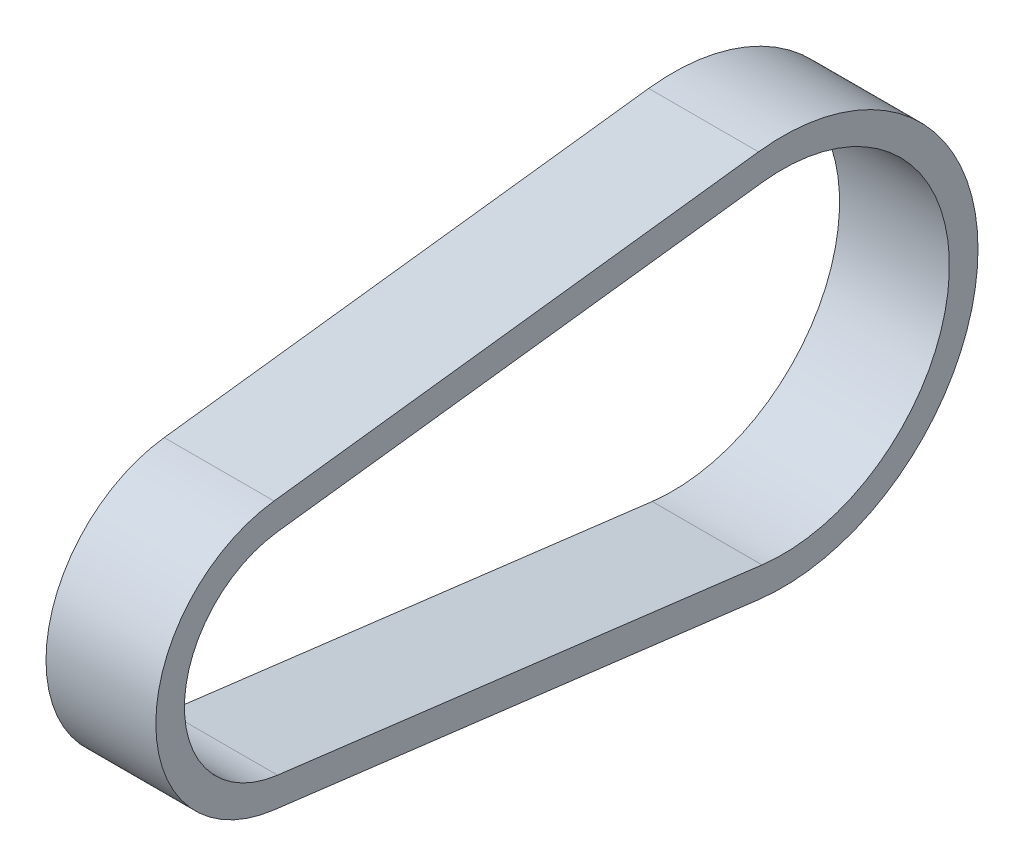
ISO-10303-21;
HEADER;
FILE_DESCRIPTION(('STEP AP214'),'2;1');
FILE_NAME('part.step','',(''),(''),'','','');
FILE_SCHEMA(('AUTOMOTIVE_DESIGN { 1 0 10303 214 1 1 1 1 }'));
ENDSEC;
DATA;
#1=APPLICATION_CONTEXT('core data for automotive mechanical design processes');
#2=APPLICATION_PROTOCOL_DEFINITION('international standard','automotive_design',2000,#1);
#3=PRODUCT_CONTEXT('',#1,'mechanical');
#4=PRODUCT('Part','Part','',(#3));
#5=PRODUCT_RELATED_PRODUCT_CATEGORY('part','',(#4));
#6=PRODUCT_DEFINITION_FORMATION('','',#4);
#7=PRODUCT_DEFINITION_CONTEXT('part definition',#1,'design');
#8=PRODUCT_DEFINITION('design','',#6,#7);
#9=PRODUCT_DEFINITION_SHAPE('','',#8);
#10=(LENGTH_UNIT() NAMED_UNIT(*) SI_UNIT(.MILLI.,.METRE.));
#11=(NAMED_UNIT(*) PLANE_ANGLE_UNIT() SI_UNIT($,.RADIAN.));
#12=(NAMED_UNIT(*) SI_UNIT($,.STERADIAN.) SOLID_ANGLE_UNIT());
#13=UNCERTAINTY_MEASURE_WITH_UNIT(LENGTH_MEASURE(1.E-05),#10,'distance_accuracy_value','');
#14=(GEOMETRIC_REPRESENTATION_CONTEXT(3) GLOBAL_UNCERTAINTY_ASSIGNED_CONTEXT((#13)) GLOBAL_UNIT_ASSIGNED_CONTEXT((#10,
#11,#12)) REPRESENTATION_CONTEXT('',''));
#15=CARTESIAN_POINT('',(0.,0.,0.));
#16=DIRECTION('',(0.,0.,1.));
#17=DIRECTION('',(1.,0.,0.));
#18=AXIS2_PLACEMENT_3D('',#15,#16,#17);
#19=CARTESIAN_POINT('',(57.6,0.,0.));
#20=DIRECTION('',(1.,0.,0.));
#21=DIRECTION('',(0.,0.,-1.));
#22=AXIS2_PLACEMENT_3D('',#19,#20,#21);
#23=PLANE('',#22);
#24=CARTESIAN_POINT('',(57.6,0.,0.));
#25=DIRECTION('',(1.,0.,0.));
#26=DIRECTION('',(0.,0.,-1.));
#27=AXIS2_PLACEMENT_3D('',#24,#25,#26);
#28=CIRCLE('',#27,70.705);
#29=CARTESIAN_POINT('',(57.6,70.166039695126,8.7134320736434));
#30=VERTEX_POINT('',#29);
#31=CARTESIAN_POINT('',(57.6,-70.1660396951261,8.7134320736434));
#32=VERTEX_POINT('',#31);
#33=EDGE_CURVE('E138',#30,#32,#28,.T.);
#34=ORIENTED_EDGE('',*,*,#33,.T.);
#35=DIRECTION('',(0.,-0.123236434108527,-0.9923773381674));
#36=VECTOR('',#35,1.);
#37=CARTESIAN_POINT('',(57.6,-70.1660396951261,8.7134320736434));
#38=LINE('',#37,#36);
#39=CARTESIAN_POINT('',(57.6,-101.718677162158,-245.368265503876));
#40=VERTEX_POINT('',#39);
#41=EDGE_CURVE('E141',#32,#40,#38,.T.);
#42=ORIENTED_EDGE('',*,*,#41,.T.);
#43=CARTESIAN_POINT('',(57.6,0.,-258.));
#44=DIRECTION('',(1.,0.,0.));
#45=DIRECTION('',(0.,0.,-1.));
#46=AXIS2_PLACEMENT_3D('',#43,#44,#45);
#47=CIRCLE('',#46,102.5);
#48=CARTESIAN_POINT('',(57.6,101.718677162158,-245.368265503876));
#49=VERTEX_POINT('',#48);
#50=EDGE_CURVE('E144',#40,#49,#47,.T.);
#51=ORIENTED_EDGE('',*,*,#50,.T.);
#52=DIRECTION('',(0.,-0.123236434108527,0.9923773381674));
#53=VECTOR('',#52,1.);
#54=CARTESIAN_POINT('',(57.6,70.166039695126,8.7134320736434));
#55=LINE('',#54,#53);
#56=EDGE_CURVE('E146',#49,#30,#55,.T.);
#57=ORIENTED_EDGE('',*,*,#56,.T.);
#58=EDGE_LOOP('',(#34,#42,#51,#57));
#59=FACE_BOUND('',#58,.T.);
#60=DIRECTION('',(0.,-0.123236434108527,0.9923773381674));
#61=VECTOR('',#60,1.);
#62=CARTESIAN_POINT('',(57.6,55.280379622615,6.86488556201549));
#63=LINE('',#62,#61);
#64=CARTESIAN_POINT('',(57.6,86.8330170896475,-247.216812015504));
#65=VERTEX_POINT('',#64);
#66=CARTESIAN_POINT('',(57.6,55.280379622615,6.86488556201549));
#67=VERTEX_POINT('',#66);
#68=EDGE_CURVE('E110',#65,#67,#63,.T.);
#69=ORIENTED_EDGE('',*,*,#68,.F.);
#70=CARTESIAN_POINT('',(57.6,0.,-258.));
#71=DIRECTION('',(1.,0.,0.));
#72=DIRECTION('',(0.,0.,-1.));
#73=AXIS2_PLACEMENT_3D('',#70,#71,#72);
#74=CIRCLE('',#73,87.5);
#75=CARTESIAN_POINT('',(57.6,-86.8330170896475,-247.216812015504));
#76=VERTEX_POINT('',#75);
#77=EDGE_CURVE('E102',#76,#65,#74,.T.);
#78=ORIENTED_EDGE('',*,*,#77,.F.);
#79=DIRECTION('',(0.,-0.123236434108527,-0.9923773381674));
#80=VECTOR('',#79,1.);
#81=CARTESIAN_POINT('',(57.6,-55.280379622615,6.86488556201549));
#82=LINE('',#81,#80);
#83=CARTESIAN_POINT('',(57.6,-55.280379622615,6.86488556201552));
#84=VERTEX_POINT('',#83);
#85=EDGE_CURVE('E124',#84,#76,#82,.T.);
#86=ORIENTED_EDGE('',*,*,#85,.F.);
#87=CARTESIAN_POINT('',(57.6,0.,0.));
#88=DIRECTION('',(1.,0.,0.));
#89=DIRECTION('',(0.,0.,-1.));
#90=AXIS2_PLACEMENT_3D('',#87,#88,#89);
#91=CIRCLE('',#90,55.705);
#92=EDGE_CURVE('E122',#67,#84,#91,.T.);
#93=ORIENTED_EDGE('',*,*,#92,.F.);
#94=EDGE_LOOP('',(#69,#78,#86,#93));
#95=FACE_BOUND('',#94,.T.);
#96=ADVANCED_FACE('F37',(#59,#95),#23,.T.);
#97=CARTESIAN_POINT('',(0.,0.,0.));
#98=DIRECTION('',(1.,0.,0.));
#99=DIRECTION('',(0.,0.,-1.));
#100=AXIS2_PLACEMENT_3D('',#97,#98,#99);
#101=PLANE('',#100);
#102=CARTESIAN_POINT('',(0.,0.,0.));
#103=DIRECTION('',(1.,0.,0.));
#104=DIRECTION('',(0.,0.,-1.));
#105=AXIS2_PLACEMENT_3D('',#102,#103,#104);
#106=CIRCLE('',#105,70.705);
#107=CARTESIAN_POINT('',(0.,70.166039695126,8.7134320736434));
#108=VERTEX_POINT('',#107);
#109=CARTESIAN_POINT('',(0.,-70.1660396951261,8.7134320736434));
#110=VERTEX_POINT('',#109);
#111=EDGE_CURVE('E118',#108,#110,#106,.T.);
#112=ORIENTED_EDGE('',*,*,#111,.F.);
#113=DIRECTION('',(0.,-0.123236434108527,0.9923773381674));
#114=VECTOR('',#113,1.);
#115=CARTESIAN_POINT('',(0.,70.166039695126,8.7134320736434));
#116=LINE('',#115,#114);
#117=CARTESIAN_POINT('',(0.,101.718677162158,-245.368265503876));
#118=VERTEX_POINT('',#117);
#119=EDGE_CURVE('E142',#118,#108,#116,.T.);
#120=ORIENTED_EDGE('',*,*,#119,.F.);
#121=CARTESIAN_POINT('',(0.,0.,-258.));
#122=DIRECTION('',(1.,0.,0.));
#123=DIRECTION('',(0.,0.,-1.));
#124=AXIS2_PLACEMENT_3D('',#121,#122,#123);
#125=CIRCLE('',#124,102.5);
#126=CARTESIAN_POINT('',(0.,-101.718677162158,-245.368265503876));
#127=VERTEX_POINT('',#126);
#128=EDGE_CURVE('E153',#127,#118,#125,.T.);
#129=ORIENTED_EDGE('',*,*,#128,.F.);
#130=DIRECTION('',(0.,-0.123236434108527,-0.9923773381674));
#131=VECTOR('',#130,1.);
#132=CARTESIAN_POINT('',(0.,-70.1660396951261,8.7134320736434));
#133=LINE('',#132,#131);
#134=EDGE_CURVE('E151',#110,#127,#133,.T.);
#135=ORIENTED_EDGE('',*,*,#134,.F.);
#136=EDGE_LOOP('',(#112,#120,#129,#135));
#137=FACE_BOUND('',#136,.T.);
#138=CARTESIAN_POINT('',(0.,0.,-258.));
#139=DIRECTION('',(1.,0.,0.));
#140=DIRECTION('',(0.,0.,-1.));
#141=AXIS2_PLACEMENT_3D('',#138,#139,#140);
#142=CIRCLE('',#141,87.5);
#143=CARTESIAN_POINT('',(0.,-86.8330170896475,-247.216812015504));
#144=VERTEX_POINT('',#143);
#145=CARTESIAN_POINT('',(0.,86.8330170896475,-247.216812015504));
#146=VERTEX_POINT('',#145);
#147=EDGE_CURVE('E60',#144,#146,#142,.T.);
#148=ORIENTED_EDGE('',*,*,#147,.T.);
#149=DIRECTION('',(0.,-0.123236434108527,0.9923773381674));
#150=VECTOR('',#149,1.);
#151=CARTESIAN_POINT('',(0.,55.280379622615,6.86488556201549));
#152=LINE('',#151,#150);
#153=CARTESIAN_POINT('',(0.,55.280379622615,6.86488556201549));
#154=VERTEX_POINT('',#153);
#155=EDGE_CURVE('E117',#146,#154,#152,.T.);
#156=ORIENTED_EDGE('',*,*,#155,.T.);
#157=CARTESIAN_POINT('',(0.,0.,0.));
#158=DIRECTION('',(1.,0.,0.));
#159=DIRECTION('',(0.,0.,-1.));
#160=AXIS2_PLACEMENT_3D('',#157,#158,#159);
#161=CIRCLE('',#160,55.705);
#162=CARTESIAN_POINT('',(0.,-55.280379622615,6.86488556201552));
#163=VERTEX_POINT('',#162);
#164=EDGE_CURVE('E130',#154,#163,#161,.T.);
#165=ORIENTED_EDGE('',*,*,#164,.T.);
#166=DIRECTION('',(0.,-0.123236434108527,-0.9923773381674));
#167=VECTOR('',#166,1.);
#168=CARTESIAN_POINT('',(0.,-55.280379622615,6.86488556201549));
#169=LINE('',#168,#167);
#170=EDGE_CURVE('E111',#163,#144,#169,.T.);
#171=ORIENTED_EDGE('',*,*,#170,.T.);
#172=EDGE_LOOP('',(#148,#156,#165,#171));
#173=FACE_BOUND('',#172,.T.);
#174=ADVANCED_FACE('F171',(#137,#173),#101,.F.);
#175=CARTESIAN_POINT('',(57.6,0.,0.));
#176=DIRECTION('',(-1.,0.,0.));
#177=DIRECTION('',(0.,0.,1.));
#178=AXIS2_PLACEMENT_3D('',#175,#176,#177);
#179=CYLINDRICAL_SURFACE('',#178,70.705);
#180=ORIENTED_EDGE('',*,*,#111,.T.);
#181=DIRECTION('',(-1.,0.,0.));
#182=VECTOR('',#181,1.);
#183=CARTESIAN_POINT('',(57.6,-70.1660396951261,8.7134320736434));
#184=LINE('',#183,#182);
#185=EDGE_CURVE('E11',#32,#110,#184,.T.);
#186=ORIENTED_EDGE('',*,*,#185,.F.);
#187=ORIENTED_EDGE('',*,*,#33,.F.);
#188=DIRECTION('',(-1.,0.,0.));
#189=VECTOR('',#188,1.);
#190=CARTESIAN_POINT('',(57.6,70.166039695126,8.7134320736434));
#191=LINE('',#190,#189);
#192=EDGE_CURVE('E148',#30,#108,#191,.T.);
#193=ORIENTED_EDGE('',*,*,#192,.T.);
#194=EDGE_LOOP('',(#180,#186,#187,#193));
#195=FACE_BOUND('',#194,.T.);
#196=ADVANCED_FACE('F39',(#195),#179,.T.);
#197=CARTESIAN_POINT('',(57.6,-70.1660396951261,8.7134320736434));
#198=DIRECTION('',(0.,0.9923773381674,-0.123236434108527));
#199=DIRECTION('',(0.,0.123236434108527,0.9923773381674));
#200=AXIS2_PLACEMENT_3D('',#197,#198,#199);
#201=PLANE('',#200);
#202=ORIENTED_EDGE('',*,*,#134,.T.);
#203=DIRECTION('',(-1.,0.,0.));
#204=VECTOR('',#203,1.);
#205=CARTESIAN_POINT('',(57.6,-101.718677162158,-245.368265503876));
#206=LINE('',#205,#204);
#207=EDGE_CURVE('E45',#40,#127,#206,.T.);
#208=ORIENTED_EDGE('',*,*,#207,.F.);
#209=ORIENTED_EDGE('',*,*,#41,.F.);
#210=ORIENTED_EDGE('',*,*,#185,.T.);
#211=EDGE_LOOP('',(#202,#208,#209,#210));
#212=FACE_BOUND('',#211,.T.);
#213=ADVANCED_FACE('F181',(#212),#201,.F.);
#214=CARTESIAN_POINT('',(57.6,0.,-258.));
#215=DIRECTION('',(-1.,0.,0.));
#216=DIRECTION('',(0.,0.,1.));
#217=AXIS2_PLACEMENT_3D('',#214,#215,#216);
#218=CYLINDRICAL_SURFACE('',#217,102.5);
#219=ORIENTED_EDGE('',*,*,#128,.T.);
#220=DIRECTION('',(-1.,0.,0.));
#221=VECTOR('',#220,1.);
#222=CARTESIAN_POINT('',(57.6,101.718677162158,-245.368265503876));
#223=LINE('',#222,#221);
#224=EDGE_CURVE('E158',#49,#118,#223,.T.);
#225=ORIENTED_EDGE('',*,*,#224,.F.);
#226=ORIENTED_EDGE('',*,*,#50,.F.);
#227=ORIENTED_EDGE('',*,*,#207,.T.);
#228=EDGE_LOOP('',(#219,#225,#226,#227));
#229=FACE_BOUND('',#228,.T.);
#230=ADVANCED_FACE('F165',(#229),#218,.T.);
#231=CARTESIAN_POINT('',(57.6,70.166039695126,8.7134320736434));
#232=DIRECTION('',(0.,-0.9923773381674,-0.123236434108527));
#233=DIRECTION('',(0.,0.123236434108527,-0.9923773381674));
#234=AXIS2_PLACEMENT_3D('',#231,#232,#233);
#235=PLANE('',#234);
#236=ORIENTED_EDGE('',*,*,#119,.T.);
#237=ORIENTED_EDGE('',*,*,#192,.F.);
#238=ORIENTED_EDGE('',*,*,#56,.F.);
#239=ORIENTED_EDGE('',*,*,#224,.T.);
#240=EDGE_LOOP('',(#236,#237,#238,#239));
#241=FACE_BOUND('',#240,.T.);
#242=ADVANCED_FACE('F175',(#241),#235,.F.);
#243=CARTESIAN_POINT('',(57.6,0.,-258.));
#244=DIRECTION('',(-1.,0.,0.));
#245=DIRECTION('',(0.,0.,1.));
#246=AXIS2_PLACEMENT_3D('',#243,#244,#245);
#247=CYLINDRICAL_SURFACE('',#246,87.5);
#248=ORIENTED_EDGE('',*,*,#147,.F.);
#249=DIRECTION('',(-1.,0.,0.));
#250=VECTOR('',#249,1.);
#251=CARTESIAN_POINT('',(57.6,-86.8330170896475,-247.216812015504));
#252=LINE('',#251,#250);
#253=EDGE_CURVE('E106',#76,#144,#252,.T.);
#254=ORIENTED_EDGE('',*,*,#253,.F.);
#255=ORIENTED_EDGE('',*,*,#77,.T.);
#256=DIRECTION('',(-1.,0.,0.));
#257=VECTOR('',#256,1.);
#258=CARTESIAN_POINT('',(57.6,86.8330170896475,-247.216812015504));
#259=LINE('',#258,#257);
#260=EDGE_CURVE('E105',#65,#146,#259,.T.);
#261=ORIENTED_EDGE('',*,*,#260,.T.);
#262=EDGE_LOOP('',(#248,#254,#255,#261));
#263=FACE_BOUND('',#262,.T.);
#264=ADVANCED_FACE('F104',(#263),#247,.F.);
#265=CARTESIAN_POINT('',(57.6,55.280379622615,6.86488556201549));
#266=DIRECTION('',(0.,-0.9923773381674,-0.123236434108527));
#267=DIRECTION('',(0.,0.123236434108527,-0.9923773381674));
#268=AXIS2_PLACEMENT_3D('',#265,#266,#267);
#269=PLANE('',#268);
#270=ORIENTED_EDGE('',*,*,#155,.F.);
#271=ORIENTED_EDGE('',*,*,#260,.F.);
#272=ORIENTED_EDGE('',*,*,#68,.T.);
#273=DIRECTION('',(-1.,0.,0.));
#274=VECTOR('',#273,1.);
#275=CARTESIAN_POINT('',(57.6,55.280379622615,6.86488556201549));
#276=LINE('',#275,#274);
#277=EDGE_CURVE('E119',#67,#154,#276,.T.);
#278=ORIENTED_EDGE('',*,*,#277,.T.);
#279=EDGE_LOOP('',(#270,#271,#272,#278));
#280=FACE_BOUND('',#279,.T.);
#281=ADVANCED_FACE('F114',(#280),#269,.T.);
#282=CARTESIAN_POINT('',(57.6,0.,0.));
#283=DIRECTION('',(-1.,0.,0.));
#284=DIRECTION('',(0.,0.,1.));
#285=AXIS2_PLACEMENT_3D('',#282,#283,#284);
#286=CYLINDRICAL_SURFACE('',#285,55.705);
#287=ORIENTED_EDGE('',*,*,#164,.F.);
#288=ORIENTED_EDGE('',*,*,#277,.F.);
#289=ORIENTED_EDGE('',*,*,#92,.T.);
#290=DIRECTION('',(-1.,0.,0.));
#291=VECTOR('',#290,1.);
#292=CARTESIAN_POINT('',(57.6,-55.280379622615,6.86488556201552));
#293=LINE('',#292,#291);
#294=EDGE_CURVE('E52',#84,#163,#293,.T.);
#295=ORIENTED_EDGE('',*,*,#294,.T.);
#296=EDGE_LOOP('',(#287,#288,#289,#295));
#297=FACE_BOUND('',#296,.T.);
#298=ADVANCED_FACE('F204',(#297),#286,.F.);
#299=CARTESIAN_POINT('',(57.6,-55.280379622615,6.86488556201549));
#300=DIRECTION('',(0.,0.9923773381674,-0.123236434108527));
#301=DIRECTION('',(0.,0.123236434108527,0.9923773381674));
#302=AXIS2_PLACEMENT_3D('',#299,#300,#301);
#303=PLANE('',#302);
#304=ORIENTED_EDGE('',*,*,#170,.F.);
#305=ORIENTED_EDGE('',*,*,#294,.F.);
#306=ORIENTED_EDGE('',*,*,#85,.T.);
#307=ORIENTED_EDGE('',*,*,#253,.T.);
#308=EDGE_LOOP('',(#304,#305,#306,#307));
#309=FACE_BOUND('',#308,.T.);
#310=ADVANCED_FACE('F208',(#309),#303,.T.);
#311=CLOSED_SHELL('',(#96,#174,#196,#213,#230,#242,#264,#281,#298,#310));
#312=MANIFOLD_SOLID_BREP('B2',#311);
#313=ADVANCED_BREP_SHAPE_REPRESENTATION('',(#18,#312),#14);
#314=SHAPE_DEFINITION_REPRESENTATION(#9,#313);
ENDSEC;
END-ISO-10303-21;
